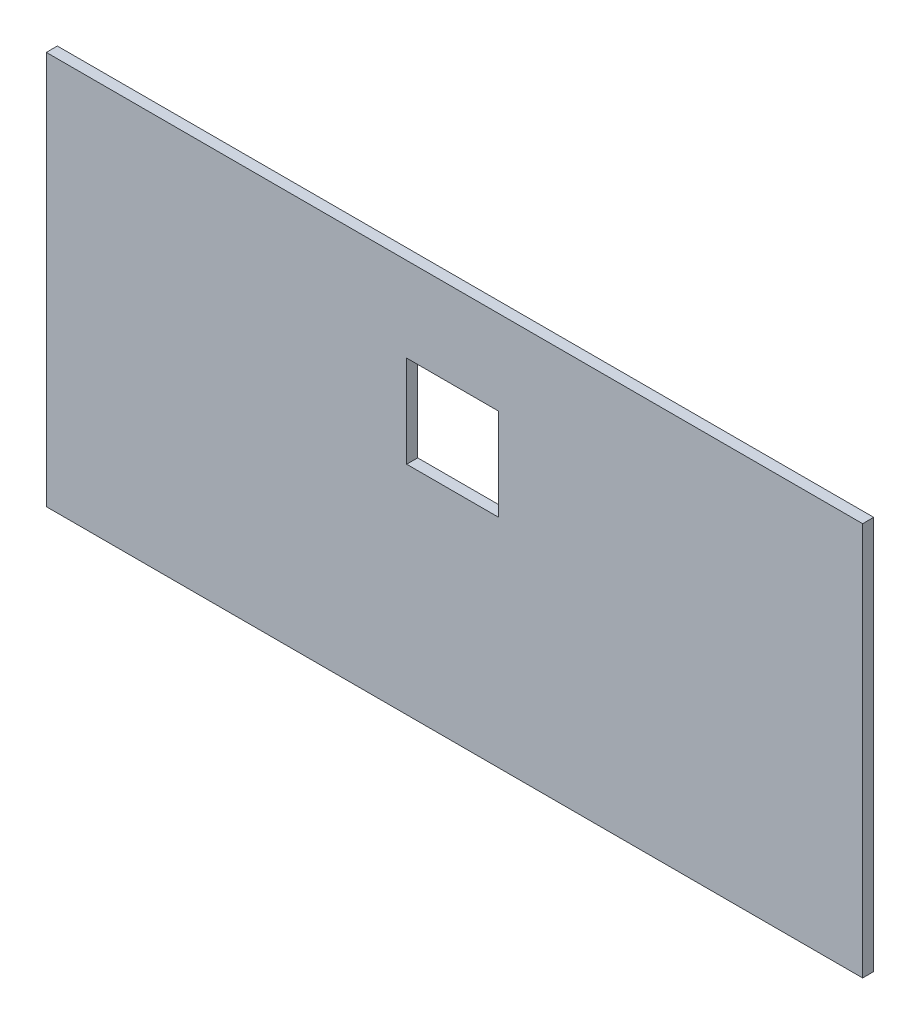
from build123d import *

# Parameters (mm, degrees)
ESQUISSE1_W             = 222
ESQUISSE1_H             = 107
EXTRUSION1_DEPTH        = 3
ESQUISSE2_W             = 25
ESQUISSE2_H             = 25
ENL_V_MAT_EXTRU_1_DEPTH = 3


with BuildPart() as part:
    # Esquisse1 → Extrusion1 (new body)
    with BuildSketch(Plane.XY):
        with Locations((111, 53.5)):
            Rectangle(ESQUISSE1_W, ESQUISSE1_H)
    extrude(amount=EXTRUSION1_DEPTH)

    # Esquisse2 → Enl_v. mat.-Extru.1 (cut)
    with BuildSketch(Plane.XY.offset(3)):
        with Locations((110.5, 71.5)):
            Rectangle(ESQUISSE2_W, ESQUISSE2_H)
    extrude(amount=-ENL_V_MAT_EXTRU_1_DEPTH, mode=Mode.SUBTRACT)


solid = part.part
